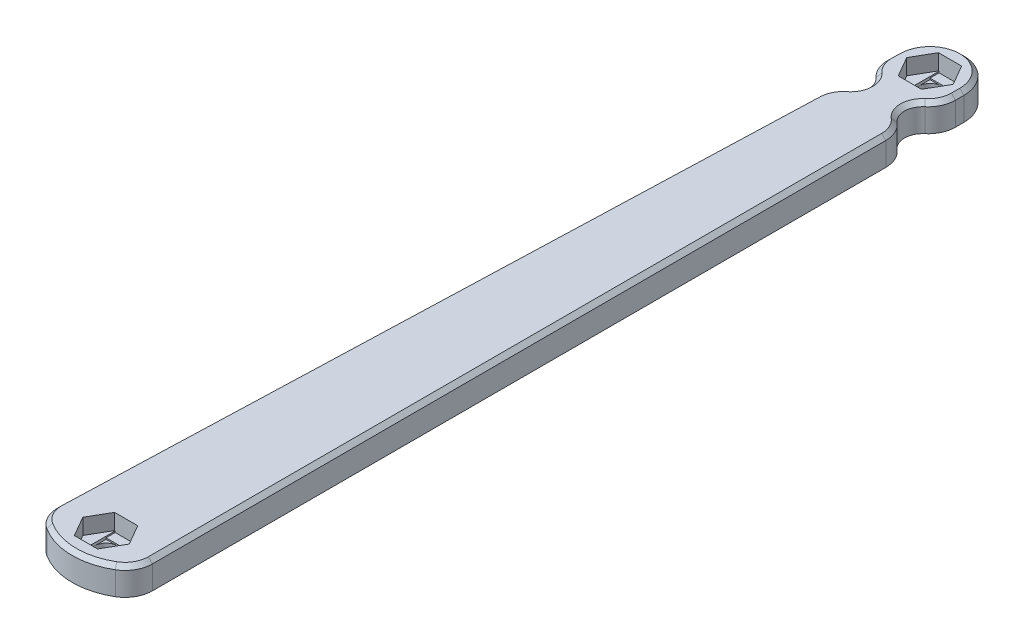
from build123d import *

# Parameters (mm, degrees)
SKETCH1_R           = 2.525
SKETCH1_R_2         = 1.6
BOSS_EXTRUDE1_DEPTH = 3.15
BOSS_EXTRUDE2_START = 0.525
SKETCH1_3_R         = 3.675
SKETCH1_3_R_2       = 2.525
SKETCH1_3_R_3       = 1.6
BOSS_EXTRUDE2_DEPTH = 0.525
BOSS_EXTRUDE3_START = 4.525
SKETCH1_4_R         = 4.95
SKETCH1_4_R_2       = 3.675
SKETCH1_4_R_3       = 2.525
SKETCH1_4_R_4       = 1.6
BOSS_EXTRUDE3_DEPTH = 4
BOSS_EXTRUDE4_START = -3.675
BOSS_EXTRUDE4_DEPTH = 4.2
FILLET2_R           = 4
SKETCH2_R           = 1.6
CUT_EXTRUDE2_DEPTH  = 2.3
SKETCH2_2_R         = 1.6
CUT_EXTRUDE3_DEPTH  = 124.974462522
CHAMFER1_SIZE       = 0.6
SKETCH4_R           = 2.5
CUT_EXTRUDE4_DEPTH  = 3.2
SKETCH5_W           = 3.2
SKETCH5_H           = 5.85
CUT_EXTRUDE5_DEPTH  = 0.2
SKETCH6_W           = 3.2
SKETCH6_H           = 3.2
CUT_EXTRUDE6_DEPTH  = 0.2
SKETCH9_R           = 2.525
CUT_EXTRUDE7_DEPTH  = 124.785713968
CUT_EXTRUDE8_DEPTH  = 124.774259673


with BuildPart() as part:
    # Sketch1 → Boss-Extrude1 (new body)
    with BuildSketch(Plane(origin=(0, 0, 0), x_dir=(1, 0, 0), z_dir=(0, 1, 0))):
        with Locations(Location((5.25, 0, 0), (0, 0, 270))):
            Circle(SKETCH1_R)
        with Locations(Location((5.25, 0, 0), (0, 0, 270))):
            Circle(SKETCH1_R_2, mode=Mode.SUBTRACT)
    extrude(amount=-BOSS_EXTRUDE1_DEPTH)

    # Sketch1_3 → Boss-Extrude2 (add)
    # profile 1 of 2: a face of its own
    with BuildSketch(Plane(origin=(0, 0, 0), x_dir=(1, 0, 0), z_dir=(0, 1, 0)).offset(BOSS_EXTRUDE2_START)):
        with Locations(Location((5.25, 0, 0), (0, 0, 270))):
            Circle(SKETCH1_3_R)
        with Locations(Location((5.25, 0, 0), (0, 0, 270))):
            Circle(SKETCH1_3_R_2, mode=Mode.SUBTRACT)
    # profile 2 of 2: a face of its own
    with BuildSketch(Plane(origin=(0, 0, 0), x_dir=(1, 0, 0), z_dir=(0, 1, 0)).offset(BOSS_EXTRUDE2_START)):
        with Locations(Location((5.25, 0, 0), (0, 0, 270))):
            Circle(SKETCH1_3_R_2)
        with Locations(Location((5.25, 0, 0), (0, 0, 270))):
            Circle(SKETCH1_3_R_3, mode=Mode.SUBTRACT)
    extrude(amount=-BOSS_EXTRUDE2_DEPTH)

    # Sketch1_4 → Boss-Extrude3 (add)
    # profile 1 of 5: a face of its own
    with BuildSketch(Plane(origin=(0, 0, 0), x_dir=(1, 0, 0), z_dir=(0, 1, 0)).offset(BOSS_EXTRUDE3_START)):
        with Locations((5.25, 0)):
            Circle(SKETCH1_4_R)
        with Locations(Location((5.25, 0, 0), (0, 0, 270))):
            Circle(SKETCH1_4_R_2, mode=Mode.SUBTRACT)
    # profile 2 of 5: a face of its own
    with BuildSketch(Plane(origin=(0, 0, 0), x_dir=(1, 0, 0), z_dir=(0, 1, 0)).offset(BOSS_EXTRUDE3_START)):
        with Locations(Location((5.25, 0, 0), (0, 0, 270))):
            Circle(SKETCH1_4_R_2)
        with Locations(Location((5.25, 0, 0), (0, 0, 270))):
            Circle(SKETCH1_4_R_3, mode=Mode.SUBTRACT)
    # profile 3 of 5: a face of its own
    with BuildSketch(Plane(origin=(0, 0, 0), x_dir=(1, 0, 0), z_dir=(0, 1, 0)).offset(BOSS_EXTRUDE3_START)):
        with Locations(Location((5.25, 0, 0), (0, 0, 270))):
            Circle(SKETCH1_4_R_3)
        with Locations(Location((5.25, 0, 0), (0, 0, 270))):
            Circle(SKETCH1_4_R_4, mode=Mode.SUBTRACT)
    # profile 4 of 5: a face of its own
    with BuildSketch(Plane(origin=(0, 0, 0), x_dir=(1, 0, 0), z_dir=(0, 1, 0)).offset(BOSS_EXTRUDE3_START)):
        with BuildLine():
            Line((10.322484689, -3.49564748), (10.197105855, 0.169244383))
            ThreePointArc((10.197105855, 0.169244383), (10.199276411, 0.084634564), (10.2, 0))
            ThreePointArc((10.2, 0), (5.25, -4.95), (0.3, 0))
            Line((0.3, 0), (0.3, -3.667035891))
            ThreePointArc((0.3, -3.667035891), (2.65, -6.3), (0.3, -8.932964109))
            Line((0.3, -8.932964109), (0.3, -112.88029726))
            Line((0.3, -112.88029726), (14.064619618, -112.88029726))
            Line((14.064619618, -112.88029726), (10.502530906, -8.758496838))
            ThreePointArc((10.502530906, -8.758496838), (8.063881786, -6.207420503), (10.322484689, -3.49564748))
        make_face()
    # profile 5 of 5: a face of its own
    with BuildSketch(Plane(origin=(0, 0, 0), x_dir=(1, 0, 0), z_dir=(0, 1, 0)).offset(BOSS_EXTRUDE3_START)):
        with BuildLine():
            Line((14.3, -119.760594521), (14.064619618, -112.88029726))
            Line((14.064619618, -112.88029726), (0.3, -112.88029726))
            Line((0.3, -112.88029726), (0.3, -120))
            ThreePointArc((0.3, -120), (7.351288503, -122.879556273), (14.3, -119.760594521))
        make_face()
    extrude(amount=-BOSS_EXTRUDE3_DEPTH)

    # Sketch1_5 → Boss-Extrude4 (add)
    with BuildSketch(Plane(origin=(0, 0, 0), x_dir=(1, 0, 0), z_dir=(0, 1, 0)).offset(BOSS_EXTRUDE4_START)):
        with BuildLine():
            Line((14.3, -119.760594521), (14.064619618, -112.88029726))
            Line((14.064619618, -112.88029726), (0.3, -112.88029726))
            Line((0.3, -112.88029726), (0.3, -120))
            ThreePointArc((0.3, -120), (7.351288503, -122.879556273), (14.3, -119.760594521))
        make_face()
    extrude(amount=BOSS_EXTRUDE4_DEPTH)

    # Fillet2
    fillet2_edges = [part.edges().sort_by_distance(p)[0] for p in [
        (0.3, 2.525, 3.667035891),
        (0.3, 2.525, 8.932964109),
        (0.3, 0.425, 120),
        (14.3, 0.425, 119.760594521),
        (10.502530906, 2.525, 8.758496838),
        (10.322484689, 2.525, 3.49564748),
    ]]
    fillet(fillet2_edges, radius=FILLET2_R)

    # Sketch2 → Cut-Extrude2 (cut)
    # profile 1 of 2: a face of its own
    with BuildSketch(Plane(origin=(0, 4.525, 0), x_dir=(1, 0, 0), z_dir=(0, 1, 0))):
        Polygon((10.644298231, -117.879926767), (8.955548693, -114.954926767), (5.578049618, -114.954926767), (3.889300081, -117.879926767), (5.578049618, -120.804926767), (8.955548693, -120.804926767), align=None)
        with Locations(Location((7.266799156, -117.879926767, 0), (0, 0, 270))):
            Circle(SKETCH2_R, mode=Mode.SUBTRACT)
    # profile 2 of 2: a face of its own
    with BuildSketch(Plane(origin=(0, 4.525, 0), x_dir=(1, 0, 0), z_dir=(0, 1, 0))):
        Polygon((6.938749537, -2.925), (8.627499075, 0), (6.938749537, 2.925), (3.561250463, 2.925), (1.872500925, 0), (3.561250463, -2.925), align=None)
    extrude(amount=-CUT_EXTRUDE2_DEPTH, mode=Mode.SUBTRACT)

    # Sketch2_2 → Cut-Extrude3 (cut, through all)
    with BuildSketch(Plane(origin=(0, 4.525, 0), x_dir=(1, 0, 0), z_dir=(0, 1, 0))):
        with Locations(Location((7.266799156, -117.879926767, 0), (0, 0, 270))):
            Circle(SKETCH2_2_R)
    extrude(amount=-CUT_EXTRUDE3_DEPTH, mode=Mode.SUBTRACT)

    # Chamfer1
    chamfer1_edges = [part.edges().sort_by_distance(p)[0] for p in [
        (5.165365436, 4.525, -4.949276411),
        (12.410347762, 4.525, 64.525026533),
        (7.351288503, 4.525, 122.879556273),
        (0.3, 4.525, 0.613639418),
        (2.65, 4.525, 6.3),
        (0.3, 4.525, 64.73211822),
        (8.063881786, 4.525, 6.207420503),
        (10.218086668, 4.525, 0.444036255),
        (0.670546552, 4.525, 2.90866745),
        (9.926225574, 4.525, 2.750391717),
        (0.670546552, 4.525, 9.69133255),
        (10.158130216, 4.525, 9.529091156),
        (0.825508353, 4.525, 120.073410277),
        (13.777308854, 4.525, 119.85192942),
    ]]
    chamfer(chamfer1_edges, length=CHAMFER1_SIZE)

    # Sketch4 → Cut-Extrude4 (cut)
    with BuildSketch(Plane.XZ.offset(-0.525)):
        with Locations(Location((9.342180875, 91.814334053, 0), (0, 0, 270))):
            Circle(SKETCH4_R)
        with Locations(Location((7.05873837, 100.232046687, 0), (0, 0, 270))):
            Circle(SKETCH4_R)
        with Locations(Location((4.300877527, 108.506477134, 0), (0, 0, 270))):
            Circle(SKETCH4_R)
    extrude(amount=-CUT_EXTRUDE4_DEPTH, mode=Mode.SUBTRACT)

    # Sketch5 → Cut-Extrude5 (cut)
    with BuildSketch(Plane(origin=(0, 2.225, 0), x_dir=(1, 0, 0), z_dir=(0, 1, 0))):
        with Locations((5.25, 0)):
            Rectangle(SKETCH5_W, SKETCH5_H)
        with Locations((7.266799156, -117.879926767)):
            Rectangle(SKETCH5_W, SKETCH5_H)
    extrude(amount=-CUT_EXTRUDE5_DEPTH, mode=Mode.SUBTRACT)

    # Sketch6 → Cut-Extrude6 (cut)
    with BuildSketch(Plane(origin=(0, 2.025, 0), x_dir=(1, 0, 0), z_dir=(0, 1, 0))):
        with Locations((5.25, 0)):
            Rectangle(SKETCH6_W, SKETCH6_H)
        with Locations((7.266799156, -117.879926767)):
            Rectangle(SKETCH6_W, SKETCH6_H)
    extrude(amount=-CUT_EXTRUDE6_DEPTH, mode=Mode.SUBTRACT)


with BuildPart() as body_2:
    # Mirror1: mirrored copy
    add(part.part.mirror(Plane.ZY))

    # Sketch9 → Cut-Extrude7 (cut, through all)
    with BuildSketch(Plane.XZ):
        with Locations((-5.25, 0)):
            Circle(SKETCH9_R)
    extrude(amount=CUT_EXTRUDE7_DEPTH, mode=Mode.SUBTRACT)

    # Sketch10 → Cut-Extrude8 (cut, through all)
    with BuildSketch(Plane.XZ.offset(-0.525)):
        with BuildLine():
            Line((-14.23474741, 117.853225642), (-14.064619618, 112.88029726))
            Line((-14.064619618, 112.88029726), (-0.3, 112.88029726))
            Line((-0.3, 112.88029726), (-0.3, 118.091515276))
            ThreePointArc((-0.3, 118.091515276), (-0.825508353, 120.073410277), (-2.263953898, 121.534554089))
            ThreePointArc((-2.263953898, 121.534554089), (-7.351288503, 122.879556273), (-12.389661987, 121.361400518))
            ThreePointArc((-12.389661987, 121.361400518), (-13.777308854, 119.85192942), (-14.23474741, 117.853225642))
        make_face()
    extrude(amount=CUT_EXTRUDE8_DEPTH, mode=Mode.SUBTRACT)


solid = body_2.part
